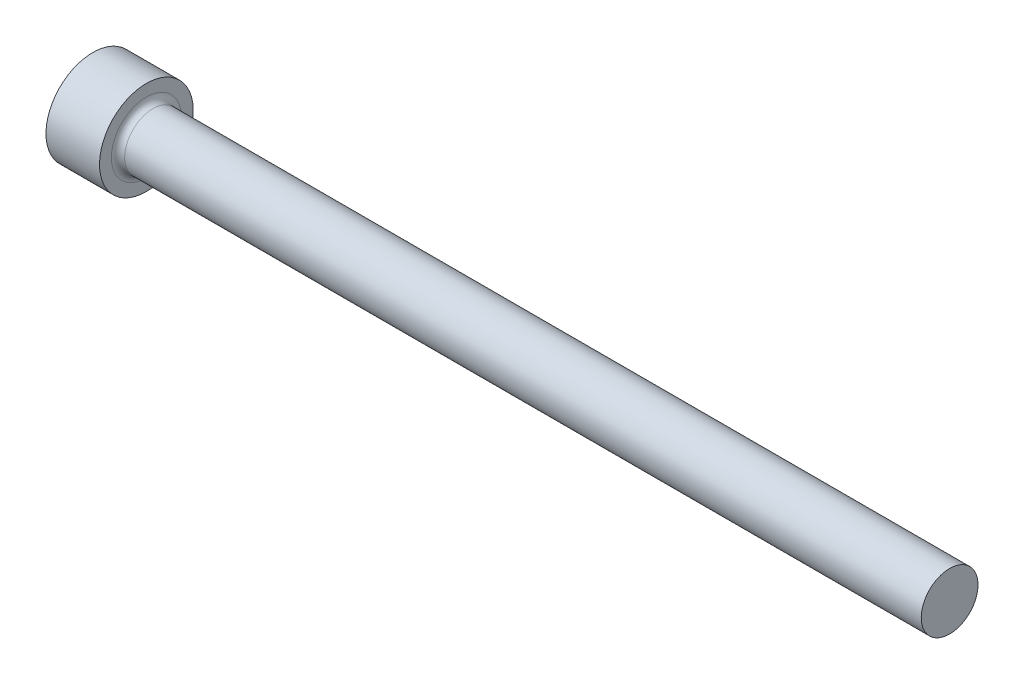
from build123d import *


with BuildPart() as part:
    # Sketch1 → PIN (revolve)
    with BuildSketch(Plane.XY, mode=Mode.PRIVATE) as pin_sk:
        with BuildLine():
            Line((0, 0), (0, 5.55625))
            Line((0, 5.55625), (6.35, 5.55625))
            Line((6.35, 5.55625), (6.35, 4.15417))
            ThreePointArc((6.35, 4.15417), (6.58062412, 3.59739412), (7.1374, 3.36677))
            Line((7.1374, 3.36677), (101.6, 3.36677))
            Line((101.6, 3.36677), (101.6, 0))
            Line((101.6, 0), (0, 0))
        make_face()
    revolve(pin_sk.sketch.rotate(Axis((101.6, 0, 0), (-1, 0, 0)), 180), axis=Axis((101.6, 0, 0), (-1, 0, 0)))


solid = part.part
